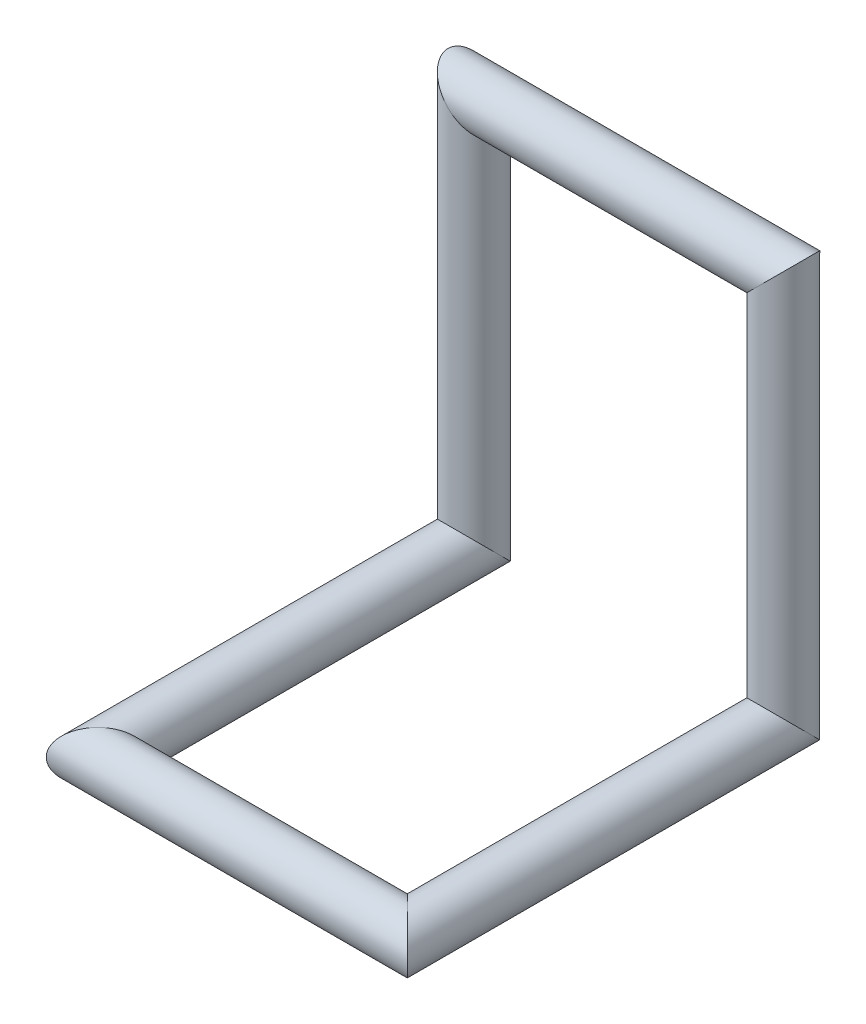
ISO-10303-21;
HEADER;
FILE_DESCRIPTION(('STEP AP214'),'2;1');
FILE_NAME('part.step','',(''),(''),'','','');
FILE_SCHEMA(('AUTOMOTIVE_DESIGN { 1 0 10303 214 1 1 1 1 }'));
ENDSEC;
DATA;
#1=APPLICATION_CONTEXT('core data for automotive mechanical design processes');
#2=APPLICATION_PROTOCOL_DEFINITION('international standard','automotive_design',2000,#1);
#3=PRODUCT_CONTEXT('',#1,'mechanical');
#4=PRODUCT('Part','Part','',(#3));
#5=PRODUCT_RELATED_PRODUCT_CATEGORY('part','',(#4));
#6=PRODUCT_DEFINITION_FORMATION('','',#4);
#7=PRODUCT_DEFINITION_CONTEXT('part definition',#1,'design');
#8=PRODUCT_DEFINITION('design','',#6,#7);
#9=PRODUCT_DEFINITION_SHAPE('','',#8);
#10=(LENGTH_UNIT() NAMED_UNIT(*) SI_UNIT(.MILLI.,.METRE.));
#11=(NAMED_UNIT(*) PLANE_ANGLE_UNIT() SI_UNIT($,.RADIAN.));
#12=(NAMED_UNIT(*) SI_UNIT($,.STERADIAN.) SOLID_ANGLE_UNIT());
#13=UNCERTAINTY_MEASURE_WITH_UNIT(LENGTH_MEASURE(1.E-05),#10,'distance_accuracy_value','');
#14=(GEOMETRIC_REPRESENTATION_CONTEXT(3) GLOBAL_UNCERTAINTY_ASSIGNED_CONTEXT((#13)) GLOBAL_UNIT_ASSIGNED_CONTEXT((#10,
#11,#12)) REPRESENTATION_CONTEXT('',''));
#15=CARTESIAN_POINT('',(0.,0.,0.));
#16=DIRECTION('',(0.,0.,1.));
#17=DIRECTION('',(1.,0.,0.));
#18=AXIS2_PLACEMENT_3D('',#15,#16,#17);
#19=CARTESIAN_POINT('',(76.2,0.,92.5693200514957));
#20=DIRECTION('',(0.,0.,-1.));
#21=DIRECTION('',(-1.,0.,0.));
#22=AXIS2_PLACEMENT_3D('',#19,#20,#21);
#23=CYLINDRICAL_SURFACE('',#22,6.35);
#24=CARTESIAN_POINT('',(76.2,0.,92.5693200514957));
#25=DIRECTION('',(0.707106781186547,0.,-0.707106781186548));
#26=DIRECTION('',(0.707106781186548,0.,0.707106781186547));
#27=AXIS2_PLACEMENT_3D('',#24,#25,#26);
#28=ELLIPSE('',#27,8.98025612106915,6.35);
#29=CARTESIAN_POINT('',(82.55,0.,98.9193200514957));
#30=VERTEX_POINT('',#29);
#31=EDGE_CURVE('E44',#30,#30,#28,.T.);
#32=ORIENTED_EDGE('',*,*,#31,.T.);
#33=EDGE_LOOP('',(#32));
#34=FACE_BOUND('',#33,.T.);
#35=CARTESIAN_POINT('',(76.2,-6.35000000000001,-6.35000000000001));
#36=CARTESIAN_POINT('',(76.246153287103,-6.35000043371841,-6.35000009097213));
#37=CARTESIAN_POINT('',(76.2923065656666,-6.34949683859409,-6.34949597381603));
#38=CARTESIAN_POINT('',(76.3846077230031,-6.34748384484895,-6.34748203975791));
#39=CARTESIAN_POINT('',(76.4307555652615,-6.34597360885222,-6.34597138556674));
#40=CARTESIAN_POINT('',(76.5230236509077,-6.34194696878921,-6.34194447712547));
#41=CARTESIAN_POINT('',(76.5691437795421,-6.33942925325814,-6.33942691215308));
#42=CARTESIAN_POINT('',(76.6613355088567,-6.33338827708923,-6.33338664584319));
#43=CARTESIAN_POINT('',(76.7074068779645,-6.32986323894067,-6.32986216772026));
#44=CARTESIAN_POINT('',(76.7764190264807,-6.32382602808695,-6.32382569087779));
#45=CARTESIAN_POINT('',(76.7994261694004,-6.32168661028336,-6.32168650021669));
#46=CARTESIAN_POINT('',(76.8453473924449,-6.31716376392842,-6.31716387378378));
#47=CARTESIAN_POINT('',(76.8682615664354,-6.31478081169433,-6.31478091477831));
#48=CARTESIAN_POINT('',(76.9370445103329,-6.30724954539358,-6.30724939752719));
#49=CARTESIAN_POINT('',(76.982832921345,-6.30172939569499,-6.30172877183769));
#50=CARTESIAN_POINT('',(77.0743302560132,-6.28968872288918,-6.28968737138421));
#51=CARTESIAN_POINT('',(77.1200381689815,-6.28316437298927,-6.28316277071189));
#52=CARTESIAN_POINT('',(77.2113535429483,-6.26911534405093,-6.26911368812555));
#53=CARTESIAN_POINT('',(77.25695970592,-6.26158644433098,-6.26158498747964));
#54=CARTESIAN_POINT('',(77.3480493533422,-6.24552893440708,-6.24552822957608));
#55=CARTESIAN_POINT('',(77.393531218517,-6.23699573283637,-6.23699558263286));
#56=CARTESIAN_POINT('',(77.484059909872,-6.21898845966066,-6.21898860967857));
#57=CARTESIAN_POINT('',(77.5291072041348,-6.20951556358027,-6.20951546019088));
#58=CARTESIAN_POINT('',(77.6190715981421,-6.18957768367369,-6.18957686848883));
#59=CARTESIAN_POINT('',(77.663986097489,-6.17910683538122,-6.17910556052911));
#60=CARTESIAN_POINT('',(77.7536624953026,-6.15717287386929,-6.15717112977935));
#61=CARTESIAN_POINT('',(77.7984213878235,-6.14570361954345,-6.14570186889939));
#62=CARTESIAN_POINT('',(77.8877650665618,-6.12177284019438,-6.12177149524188));
#63=CARTESIAN_POINT('',(77.9323464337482,-6.10930492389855,-6.10930399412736));
#64=CARTESIAN_POINT('',(77.9989462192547,-6.08989582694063,-6.08989552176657));
#65=CARTESIAN_POINT('',(78.0211608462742,-6.08328930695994,-6.08328921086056));
#66=CARTESIAN_POINT('',(78.0653162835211,-6.06989490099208,-6.06989499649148));
#67=CARTESIAN_POINT('',(78.0872579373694,-6.06310840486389,-6.06310848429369));
#68=CARTESIAN_POINT('',(78.1531544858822,-6.04233548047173,-6.04233526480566));
#69=CARTESIAN_POINT('',(78.196901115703,-6.02801722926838,-6.02801648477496));
#70=CARTESIAN_POINT('',(78.2841920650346,-5.99839863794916,-5.99839710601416));
#71=CARTESIAN_POINT('',(78.3277313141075,-5.98309083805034,-5.98308904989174));
#72=CARTESIAN_POINT('',(78.4145854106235,-5.95149275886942,-5.95149095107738));
#73=CARTESIAN_POINT('',(78.4578947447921,-5.93519490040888,-5.93519333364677));
#74=CARTESIAN_POINT('',(78.5442657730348,-5.90161711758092,-5.90161638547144));
#75=CARTESIAN_POINT('',(78.5873215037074,-5.88432952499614,-5.88432938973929));
#76=CARTESIAN_POINT('',(78.6725861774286,-5.84901174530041,-5.84901188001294));
#77=CARTESIAN_POINT('',(78.7147978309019,-5.83098482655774,-5.83098463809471));
#78=CARTESIAN_POINT('',(78.7989735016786,-5.79396003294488,-5.79395901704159));
#79=CARTESIAN_POINT('',(78.8409303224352,-5.77495398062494,-5.77495245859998));
#80=CARTESIAN_POINT('',(78.9245724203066,-5.73597041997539,-5.73596840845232));
#81=CARTESIAN_POINT('',(78.9662500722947,-5.71598473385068,-5.71598274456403));
#82=CARTESIAN_POINT('',(79.049310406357,-5.67504159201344,-5.67504011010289));
#83=CARTESIAN_POINT('',(79.090685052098,-5.65407597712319,-5.65407498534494));
#84=CARTESIAN_POINT('',(79.1523375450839,-5.62198769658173,-5.62198738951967));
#85=CARTESIAN_POINT('',(79.1729025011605,-5.6111397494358,-5.61113966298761));
#86=CARTESIAN_POINT('',(79.2135898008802,-5.58939193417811,-5.58939201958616));
#87=CARTESIAN_POINT('',(79.2337144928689,-5.57849426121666,-5.57849430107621));
#88=CARTESIAN_POINT('',(79.2941580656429,-5.54534134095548,-5.54534098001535));
#89=CARTESIAN_POINT('',(79.334181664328,-5.52281617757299,-5.52281519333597));
#90=CARTESIAN_POINT('',(79.4139138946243,-5.47680577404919,-5.47680389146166));
#91=CARTESIAN_POINT('',(79.4536129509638,-5.45331224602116,-5.45331009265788));
#92=CARTESIAN_POINT('',(79.5326714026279,-5.40536441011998,-5.40536230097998));
#93=CARTESIAN_POINT('',(79.5720208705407,-5.3809019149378,-5.38090012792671));
#94=CARTESIAN_POINT('',(79.650354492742,-5.33101643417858,-5.33101564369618));
#95=CARTESIAN_POINT('',(79.6893283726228,-5.3055853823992,-5.30558527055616));
#96=CARTESIAN_POINT('',(79.7660468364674,-5.25432374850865,-5.25432385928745));
#97=CARTESIAN_POINT('',(79.8037995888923,-5.22849927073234,-5.22849893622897));
#98=CARTESIAN_POINT('',(79.8789523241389,-5.17590003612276,-5.1758986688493));
#99=CARTESIAN_POINT('',(79.9163410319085,-5.14911722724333,-5.14911527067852));
#100=CARTESIAN_POINT('',(79.9907387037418,-5.09460056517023,-5.09459808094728));
#101=CARTESIAN_POINT('',(80.0277360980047,-5.06685881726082,-5.06685640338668));
#102=CARTESIAN_POINT('',(80.1013242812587,-5.01042385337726,-5.01042212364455));
#103=CARTESIAN_POINT('',(80.1379032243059,-4.98172290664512,-4.98172179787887));
#104=CARTESIAN_POINT('',(80.1922658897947,-4.9381028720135,-4.93810255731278));
#105=CARTESIAN_POINT('',(80.2103896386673,-4.92339492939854,-4.92339485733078));
#106=CARTESIAN_POINT('',(80.2460416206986,-4.89413610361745,-4.89413617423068));
#107=CARTESIAN_POINT('',(80.2635744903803,-4.879588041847,-4.8795880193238));
#108=CARTESIAN_POINT('',(80.316213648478,-4.83543154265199,-4.83543094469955));
#109=CARTESIAN_POINT('',(80.350977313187,-4.80561846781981,-4.80561708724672));
#110=CARTESIAN_POINT('',(80.4200904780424,-4.74504771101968,-4.7450452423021));
#111=CARTESIAN_POINT('',(80.4544269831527,-4.71428262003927,-4.71427985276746));
#112=CARTESIAN_POINT('',(80.5226567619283,-4.65180700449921,-4.65180438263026));
#113=CARTESIAN_POINT('',(80.5565368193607,-4.62008925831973,-4.62008709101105));
#114=CARTESIAN_POINT('',(80.6238238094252,-4.55570867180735,-4.5557077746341));
#115=CARTESIAN_POINT('',(80.6572173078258,-4.52303881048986,-4.52303873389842));
#116=CARTESIAN_POINT('',(80.7224350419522,-4.45782108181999,-4.45782115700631));
#117=CARTESIAN_POINT('',(80.7542768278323,-4.42528197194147,-4.42528140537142));
#118=CARTESIAN_POINT('',(80.8175196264,-4.3592584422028,-4.35925650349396));
#119=CARTESIAN_POINT('',(80.8489063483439,-4.32576717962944,-4.3257645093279));
#120=CARTESIAN_POINT('',(80.9112067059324,-4.2578383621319,-4.2578350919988));
#121=CARTESIAN_POINT('',(80.94210586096,-4.2233941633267,-4.22339103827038));
#122=CARTESIAN_POINT('',(81.0033985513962,-4.15355910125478,-4.15355694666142));
#123=CARTESIAN_POINT('',(81.0337774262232,-4.11816179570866,-4.11816047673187));
#124=CARTESIAN_POINT('',(81.07877337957,-4.06455688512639,-4.06455654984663));
#125=CARTESIAN_POINT('',(81.0937576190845,-4.04650280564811,-4.04650275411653));
#126=CARTESIAN_POINT('',(81.1229988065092,-4.01087231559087,-4.0108723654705));
#127=CARTESIAN_POINT('',(81.1372636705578,-3.9932991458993,-3.9932990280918));
#128=CARTESIAN_POINT('',(81.1800600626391,-3.93999943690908,-3.9399984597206));
#129=CARTESIAN_POINT('',(81.2082290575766,-3.90412712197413,-3.90412509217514));
#130=CARTESIAN_POINT('',(81.2640726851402,-3.83142316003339,-3.83141971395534));
#131=CARTESIAN_POINT('',(81.2917315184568,-3.79458544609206,-3.79458164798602));
#132=CARTESIAN_POINT('',(81.3465183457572,-3.71994982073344,-3.71994632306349));
#133=CARTESIAN_POINT('',(81.3736303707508,-3.68214604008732,-3.68214321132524));
#134=CARTESIAN_POINT('',(81.4272862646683,-3.60557882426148,-3.60557773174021));
#135=CARTESIAN_POINT('',(81.4538139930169,-3.56680973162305,-3.56680971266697));
#136=CARTESIAN_POINT('',(81.5050131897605,-3.49018472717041,-3.49018474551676));
#137=CARTESIAN_POINT('',(81.5297169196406,-3.45233955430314,-3.45233860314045));
#138=CARTESIAN_POINT('',(81.5786205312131,-3.37565500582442,-3.3756520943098));
#139=CARTESIAN_POINT('',(81.6028030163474,-3.33681008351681,-3.33680618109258));
#140=CARTESIAN_POINT('',(81.6506220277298,-3.25812475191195,-3.25812010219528));
#141=CARTESIAN_POINT('',(81.6742409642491,-3.21827898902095,-3.21827460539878));
#142=CARTESIAN_POINT('',(81.7208901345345,-3.13759174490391,-3.13758881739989));
#143=CARTESIAN_POINT('',(81.74390258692,-3.09674511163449,-3.09674339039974));
#144=CARTESIAN_POINT('',(81.7777997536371,-3.03499766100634,-3.03499727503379));
#145=CARTESIAN_POINT('',(81.7890653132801,-3.01420086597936,-3.01420084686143));
#146=CARTESIAN_POINT('',(81.8107613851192,-2.97361037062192,-2.97361038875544));
#147=CARTESIAN_POINT('',(81.8212050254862,-2.95382016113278,-2.95381988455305));
#148=CARTESIAN_POINT('',(81.8525073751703,-2.89373830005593,-2.89373665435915));
#149=CARTESIAN_POINT('',(81.8729999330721,-2.85335118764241,-2.85334797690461));
#150=CARTESIAN_POINT('',(81.9134379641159,-2.7715072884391,-2.77150202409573));
#151=CARTESIAN_POINT('',(81.9333635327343,-2.73004557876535,-2.73003984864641));
#152=CARTESIAN_POINT('',(81.9726166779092,-2.64605154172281,-2.6460463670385));
#153=CARTESIAN_POINT('',(81.9919240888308,-2.60351448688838,-2.60351036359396));
#154=CARTESIAN_POINT('',(82.02988885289,-2.51737067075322,-2.51736918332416));
#155=CARTESIAN_POINT('',(82.0485257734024,-2.47375940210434,-2.47375950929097));
#156=CARTESIAN_POINT('',(82.0837104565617,-2.38881608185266,-2.38881598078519));
#157=CARTESIAN_POINT('',(82.1003167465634,-2.34749604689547,-2.347494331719));
#158=CARTESIAN_POINT('',(82.1330031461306,-2.26363630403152,-2.26363140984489));
#159=CARTESIAN_POINT('',(82.14905962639,-2.22109198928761,-2.22108553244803));
#160=CARTESIAN_POINT('',(82.1805826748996,-2.13478172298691,-2.13477415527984));
#161=CARTESIAN_POINT('',(82.1960251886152,-2.09101135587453,-2.09100429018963));
#162=CARTESIAN_POINT('',(82.226255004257,-2.00224898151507,-2.00224435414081));
#163=CARTESIAN_POINT('',(82.2410178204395,-1.95725278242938,-1.95725012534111));
#164=CARTESIAN_POINT('',(82.2624955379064,-1.8892396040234,-1.88923908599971));
#165=CARTESIAN_POINT('',(82.2696014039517,-1.86628381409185,-1.86628387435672));
#166=CARTESIAN_POINT('',(82.2828883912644,-1.82248248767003,-1.82248243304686));
#167=CARTESIAN_POINT('',(82.2890938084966,-1.80164057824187,-1.80163994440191));
#168=CARTESIAN_POINT('',(82.3076850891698,-1.73800713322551,-1.73800391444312));
#169=CARTESIAN_POINT('',(82.3197136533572,-1.69516355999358,-1.69515747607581));
#170=CARTESIAN_POINT('',(82.343220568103,-1.60793293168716,-1.60792307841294));
#171=CARTESIAN_POINT('',(82.3546676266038,-1.56354163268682,-1.56353094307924));
#172=CARTESIAN_POINT('',(82.3769225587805,-1.47321414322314,-1.47320468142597));
#173=CARTESIAN_POINT('',(82.3876982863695,-1.42727394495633,-1.42726664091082));
#174=CARTESIAN_POINT('',(82.4085185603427,-1.3338508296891,-1.33384801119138));
#175=CARTESIAN_POINT('',(82.4185300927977,-1.28636422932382,-1.2863637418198));
#176=CARTESIAN_POINT('',(82.4367672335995,-1.19468000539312,-1.19468045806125));
#177=CARTESIAN_POINT('',(82.4450693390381,-1.15048983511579,-1.15048915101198));
#178=CARTESIAN_POINT('',(82.4631746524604,-1.04815306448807,-1.04815190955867));
#179=CARTESIAN_POINT('',(82.4726322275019,-0.989975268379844,-0.989975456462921));
#180=CARTESIAN_POINT('',(82.48612991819,-0.898981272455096,-0.898981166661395));
#181=CARTESIAN_POINT('',(82.4907298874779,-0.8662053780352,-0.866204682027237));
#182=CARTESIAN_POINT('',(82.5011811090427,-0.787263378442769,-0.787261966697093));
#183=CARTESIAN_POINT('',(82.5067790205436,-0.741080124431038,-0.74107887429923));
#184=CARTESIAN_POINT('',(82.5145245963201,-0.67072290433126,-0.670722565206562));
#185=CARTESIAN_POINT('',(82.5170434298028,-0.646569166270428,-0.646569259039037));
#186=CARTESIAN_POINT('',(82.5214910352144,-0.601411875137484,-0.601411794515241));
#187=CARTESIAN_POINT('',(82.5234538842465,-0.580409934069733,-0.580409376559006));
#188=CARTESIAN_POINT('',(82.5293312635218,-0.513952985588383,-0.513951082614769));
#189=CARTESIAN_POINT('',(82.5328591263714,-0.468480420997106,-0.468477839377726));
#190=CARTESIAN_POINT('',(82.5383746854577,-0.385863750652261,-0.385862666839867));
#191=CARTESIAN_POINT('',(82.5405262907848,-0.348725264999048,-0.348725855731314));
#192=CARTESIAN_POINT('',(82.5447643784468,-0.262457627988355,-0.262456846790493));
#193=CARTESIAN_POINT('',(82.5466061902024,-0.213323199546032,-0.213317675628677));
#194=CARTESIAN_POINT('',(82.5492924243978,-0.109460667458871,-0.109453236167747));
#195=CARTESIAN_POINT('',(82.5499999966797,-0.0547303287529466,-0.054726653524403));
#196=CARTESIAN_POINT('',(82.5500000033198,0.0547225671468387,0.0547188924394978));
#197=CARTESIAN_POINT('',(82.5492926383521,0.109445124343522,0.109437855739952));
#198=CARTESIAN_POINT('',(82.5468167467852,0.20518753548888,0.205181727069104));
#199=CARTESIAN_POINT('',(82.5453577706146,0.246212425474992,0.24620973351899));
#200=CARTESIAN_POINT('',(82.5431330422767,0.295345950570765,0.295345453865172));
#201=CARTESIAN_POINT('',(82.5427498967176,0.303462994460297,0.303462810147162));
#202=CARTESIAN_POINT('',(82.5405268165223,0.348714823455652,0.348715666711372));
#203=CARTESIAN_POINT('',(82.5383758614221,0.385843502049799,0.385842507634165));
#204=CARTESIAN_POINT('',(82.5328611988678,0.468452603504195,0.468449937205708));
#205=CARTESIAN_POINT('',(82.5293333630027,0.513927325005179,0.513925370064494));
#206=CARTESIAN_POINT('',(82.5234553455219,0.580394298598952,0.580393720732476));
#207=CARTESIAN_POINT('',(82.5214918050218,0.601404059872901,0.601403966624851));
#208=CARTESIAN_POINT('',(82.5170442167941,0.646561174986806,0.646561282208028));
#209=CARTESIAN_POINT('',(82.51452626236,0.670706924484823,0.670706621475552));
#210=CARTESIAN_POINT('',(82.5067820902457,0.74105385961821,0.741052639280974));
#211=CARTESIAN_POINT('',(82.5011846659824,0.78723479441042,0.787233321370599));
#212=CARTESIAN_POINT('',(82.4907327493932,0.86618498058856,0.866184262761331));
#213=CARTESIAN_POINT('',(82.4861313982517,0.898971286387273,0.898971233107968));
#214=CARTESIAN_POINT('',(82.4795066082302,0.943631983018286,0.943632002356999));
#215=CARTESIAN_POINT('',(82.4777082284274,0.955522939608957,0.955522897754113));
#216=CARTESIAN_POINT('',(82.4687367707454,1.01372337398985,1.01372291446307));
#217=CARTESIAN_POINT('',(82.4610790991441,1.05999630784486,1.05999514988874));
#218=CARTESIAN_POINT('',(82.4450736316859,1.15046697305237,1.1504662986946));
#219=CARTESIAN_POINT('',(82.4367694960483,1.19466862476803,1.19466905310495));
#220=CARTESIAN_POINT('',(82.4185316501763,1.28635640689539,1.28635594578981));
#221=CARTESIAN_POINT('',(82.4085218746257,1.33383511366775,1.3338324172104));
#222=CARTESIAN_POINT('',(82.38770445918,1.42724706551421,1.42723990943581));
#223=CARTESIAN_POINT('',(82.3769297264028,1.47318397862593,1.47317459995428));
#224=CARTESIAN_POINT('',(82.3546758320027,1.56350936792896,1.56349863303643));
#225=CARTESIAN_POINT('',(82.3432287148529,1.60790183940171,1.60789187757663));
#226=CARTESIAN_POINT('',(82.319720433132,1.69513923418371,1.69513295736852));
#227=CARTESIAN_POINT('',(82.3076904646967,1.73798838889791,1.73798495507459));
#228=CARTESIAN_POINT('',(82.2890964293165,1.8016317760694,1.80163103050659));
#229=CARTESIAN_POINT('',(82.2828897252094,1.82247809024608,1.82247797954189));
#230=CARTESIAN_POINT('',(82.2696027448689,1.86627939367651,1.86627951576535));
#231=CARTESIAN_POINT('',(82.2624982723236,1.8892307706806,1.88923037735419));
#232=CARTESIAN_POINT('',(82.2410238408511,1.95723406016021,1.9572316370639));
#233=CARTESIAN_POINT('',(82.2262629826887,2.00222483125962,2.00222040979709));
#234=CARTESIAN_POINT('',(82.1960358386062,2.0909807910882,2.09097381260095));
#235=CARTESIAN_POINT('',(82.1805939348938,2.1347501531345,2.13474258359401));
#236=CARTESIAN_POINT('',(82.1490705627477,2.22106276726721,2.22105613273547));
#237=CARTESIAN_POINT('',(82.1330130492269,2.26361041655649,2.26360525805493));
#238=CARTESIAN_POINT('',(82.1003227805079,2.34748103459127,2.34747908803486));
#239=CARTESIAN_POINT('',(82.083713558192,2.38880859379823,2.38880837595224));
#240=CARTESIAN_POINT('',(82.0485288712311,2.47375192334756,2.47375215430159));
#241=CARTESIAN_POINT('',(82.029895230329,2.51735574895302,2.51735451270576));
#242=CARTESIAN_POINT('',(81.9919354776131,2.60348908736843,2.60348523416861));
#243=CARTESIAN_POINT('',(81.9726296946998,2.6460230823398,2.64601807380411));
#244=CARTESIAN_POINT('',(81.9333779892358,2.73001523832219,2.73000945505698));
#245=CARTESIAN_POINT('',(81.9134521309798,2.77147810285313,2.77147267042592));
#246=CARTESIAN_POINT('',(81.8730114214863,2.85332843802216,2.85332490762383));
#247=CARTESIAN_POINT('',(81.8525163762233,2.89372080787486,2.89371880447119));
#248=CARTESIAN_POINT('',(81.8212093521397,2.95381196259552,2.95381149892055));
#249=CARTESIAN_POINT('',(81.8107635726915,2.97360627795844,2.97360620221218));
#250=CARTESIAN_POINT('',(81.789067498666,3.01419677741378,3.01419685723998));
#251=CARTESIAN_POINT('',(81.7778041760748,3.0349894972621,3.03498931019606));
#252=CARTESIAN_POINT('',(81.7439121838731,3.09672784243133,3.09672649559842));
#253=CARTESIAN_POINT('',(81.7209027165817,3.13756951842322,3.13756692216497));
#254=CARTESIAN_POINT('',(81.6742574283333,3.21825096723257,3.21824673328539));
#255=CARTESIAN_POINT('',(81.6506392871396,3.25809586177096,3.25809122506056));
#256=CARTESIAN_POINT('',(81.6028194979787,3.33678344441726,3.33677928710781));
#257=CARTESIAN_POINT('',(81.5786353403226,3.37563145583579,3.37562815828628));
#258=CARTESIAN_POINT('',(81.5297257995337,3.4523259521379,3.45232465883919));
#259=CARTESIAN_POINT('',(81.5050177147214,3.49017795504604,3.49017780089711));
#260=CARTESIAN_POINT('',(81.4538184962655,3.56680299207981,3.56680315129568));
#261=CARTESIAN_POINT('',(81.4272954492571,3.60556540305,3.60556467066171));
#262=CARTESIAN_POINT('',(81.3736465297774,3.68212329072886,3.68212085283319));
#263=CARTESIAN_POINT('',(81.3465366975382,3.71992438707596,3.71992113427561));
#264=CARTESIAN_POINT('',(81.2917516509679,3.79455844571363,3.79455458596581));
#265=CARTESIAN_POINT('',(81.2640923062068,3.83139724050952,3.83139357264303));
#266=CARTESIAN_POINT('',(81.2082447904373,3.90410700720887,3.90410454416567));
#267=CARTESIAN_POINT('',(81.1800723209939,3.93998400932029,3.93998254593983));
#268=CARTESIAN_POINT('',(81.1372695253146,3.99329193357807,3.99329156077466));
#269=CARTESIAN_POINT('',(81.123001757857,4.01086871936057,4.01086864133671));
#270=CARTESIAN_POINT('',(81.0937605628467,4.04649921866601,4.04649929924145));
#271=CARTESIAN_POINT('',(81.0787793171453,4.06454973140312,4.06454966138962));
#272=CARTESIAN_POINT('',(81.0337902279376,4.11814670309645,4.11814588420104));
#273=CARTESIAN_POINT('',(81.0034152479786,4.15353972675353,4.15353801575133));
#274=CARTESIAN_POINT('',(80.9421274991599,4.22336985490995,4.22336693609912));
#275=CARTESIAN_POINT('',(80.911229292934,4.25781335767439,4.25781011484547));
#276=CARTESIAN_POINT('',(80.8489277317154,4.32574423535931,4.32574124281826));
#277=CARTESIAN_POINT('',(80.8175387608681,4.35923820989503,4.35923577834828));
#278=CARTESIAN_POINT('',(80.7542882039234,4.42527034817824,4.425269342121));
#279=CARTESIAN_POINT('',(80.7224408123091,4.45781531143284,4.45781516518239));
#280=CARTESIAN_POINT('',(80.6572230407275,4.52303307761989,4.52303322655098));
#281=CARTESIAN_POINT('',(80.6238354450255,4.55569728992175,4.55569684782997));
#282=CARTESIAN_POINT('',(80.5565571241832,4.62007007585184,4.62006840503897));
#283=CARTESIAN_POINT('',(80.5226797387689,4.65178561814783,4.65178331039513));
#284=CARTESIAN_POINT('',(80.454452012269,4.71426004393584,4.71425720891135));
#285=CARTESIAN_POINT('',(80.4201147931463,4.74502609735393,4.74502336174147));
#286=CARTESIAN_POINT('',(80.3509966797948,4.80560179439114,4.8055998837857));
#287=CARTESIAN_POINT('',(80.3162286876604,4.83541879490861,4.83541760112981));
#288=CARTESIAN_POINT('',(80.2635816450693,4.8795821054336,4.87958176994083));
#289=CARTESIAN_POINT('',(80.2460452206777,4.89413314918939,4.89413306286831));
#290=CARTESIAN_POINT('',(80.21039322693,4.92339198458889,4.92339207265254));
#291=CARTESIAN_POINT('',(80.1922731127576,4.93809701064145,4.93809701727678));
#292=CARTESIAN_POINT('',(80.1379187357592,4.98171059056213,4.98171008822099));
#293=CARTESIAN_POINT('',(80.1013444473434,5.0104080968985,5.01040690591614));
#294=CARTESIAN_POINT('',(80.0277620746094,5.06683918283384,5.06683702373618));
#295=CARTESIAN_POINT('',(79.9907657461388,5.09458043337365,5.09457798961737));
#296=CARTESIAN_POINT('',(79.916366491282,5.14909888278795,5.14909654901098));
#297=CARTESIAN_POINT('',(79.878975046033,5.17588391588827,5.17588196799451));
#298=CARTESIAN_POINT('',(79.8038130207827,5.22849008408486,5.22848922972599));
#299=CARTESIAN_POINT('',(79.766053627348,5.25431921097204,5.25431906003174));
#300=CARTESIAN_POINT('',(79.6893351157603,5.30558087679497,5.30558102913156));
#301=CARTESIAN_POINT('',(79.6503681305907,5.33100753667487,5.3310072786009));
#302=CARTESIAN_POINT('',(79.5720445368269,5.38088705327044,5.38088584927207));
#303=CARTESIAN_POINT('',(79.5326981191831,5.40534790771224,5.40534616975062));
#304=CARTESIAN_POINT('',(79.4536419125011,5.45329497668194,5.45329275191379));
#305=CARTESIAN_POINT('',(79.4139419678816,5.47678930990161,5.47678712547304));
#306=CARTESIAN_POINT('',(79.3342039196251,5.52280359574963,5.52280200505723));
#307=CARTESIAN_POINT('',(79.2941753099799,5.54533176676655,5.54533072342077));
#308=CARTESIAN_POINT('',(79.2337226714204,5.57848983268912,5.57848951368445));
#309=CARTESIAN_POINT('',(79.2135939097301,5.58938973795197,5.58938964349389));
#310=CARTESIAN_POINT('',(79.172906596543,5.6111375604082,5.6111376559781));
#311=CARTESIAN_POINT('',(79.1523457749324,5.6219833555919,5.62198341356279));
#312=CARTESIAN_POINT('',(79.0907026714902,5.65406692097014,5.65406661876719));
#313=CARTESIAN_POINT('',(79.0493332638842,5.67503006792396,5.67502919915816));
#314=CARTESIAN_POINT('',(78.966279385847,5.7159705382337,5.71596884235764));
#315=CARTESIAN_POINT('',(78.9246028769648,5.73595594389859,5.73595398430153));
#316=CARTESIAN_POINT('',(78.8409588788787,5.77494094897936,5.77493900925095));
#317=CARTESIAN_POINT('',(78.7989989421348,5.793948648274,5.79394698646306));
#318=CARTESIAN_POINT('',(78.7148128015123,5.83097843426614,5.83097766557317));
#319=CARTESIAN_POINT('',(78.6725937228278,5.84900861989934,5.84900846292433));
#320=CARTESIAN_POINT('',(78.5873290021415,5.88432641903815,5.8843265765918));
#321=CARTESIAN_POINT('',(78.5442808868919,5.90161105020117,5.90161090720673));
#322=CARTESIAN_POINT('',(78.4579208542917,5.93518493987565,5.9351840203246));
#323=CARTESIAN_POINT('',(78.4146148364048,5.95148178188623,5.95148038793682));
#324=CARTESIAN_POINT('',(78.3277630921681,5.98307954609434,5.98307768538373));
#325=CARTESIAN_POINT('',(78.2842228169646,5.99838796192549,5.9983861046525));
#326=CARTESIAN_POINT('',(78.1969254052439,6.02800922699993,6.02800782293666));
#327=CARTESIAN_POINT('',(78.1531732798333,6.04232944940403,6.04232849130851));
#328=CARTESIAN_POINT('',(78.0872668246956,6.06310565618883,6.06310534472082));
#329=CARTESIAN_POINT('',(78.0653207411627,6.06989354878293,6.06989344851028));
#330=CARTESIAN_POINT('',(78.0211652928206,6.08328795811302,6.08328805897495));
#331=CARTESIAN_POINT('',(77.998955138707,6.0898931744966,6.08989326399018));
#332=CARTESIAN_POINT('',(77.9323654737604,6.10929948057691,6.10929929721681));
#333=CARTESIAN_POINT('',(77.8877897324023,6.12176599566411,6.12176531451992));
#334=CARTESIAN_POINT('',(77.7984529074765,6.14569541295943,6.14569398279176));
#335=CARTESIAN_POINT('',(77.753695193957,6.15716461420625,6.15716293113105));
#336=CARTESIAN_POINT('',(77.664016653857,6.17909962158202,6.17909790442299));
#337=CARTESIAN_POINT('',(77.6190987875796,6.18957147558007,6.18956997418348));
#338=CARTESIAN_POINT('',(77.5291231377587,6.20951221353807,6.20951149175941));
#339=CARTESIAN_POINT('',(77.4840679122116,6.21898686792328,6.21898670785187));
#340=CARTESIAN_POINT('',(77.3935391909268,6.23699414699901,6.23699430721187));
#341=CARTESIAN_POINT('',(77.3480653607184,6.24552593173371,6.24552584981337));
#342=CARTESIAN_POINT('',(77.2569872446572,6.26158176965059,6.26158099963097));
#343=CARTESIAN_POINT('',(77.2113845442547,6.2691103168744,6.26910910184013));
#344=CARTESIAN_POINT('',(77.1200715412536,6.28315949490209,6.28315782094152));
#345=CARTESIAN_POINT('',(77.074362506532,6.28968424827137,6.28968255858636));
#346=CARTESIAN_POINT('',(76.982858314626,6.30172628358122,6.30172497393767));
#347=CARTESIAN_POINT('',(76.9370641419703,6.3072472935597,6.30724637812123));
#348=CARTESIAN_POINT('',(76.868270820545,6.31477984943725,6.31477954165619));
#349=CARTESIAN_POINT('',(76.8453520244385,6.31716330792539,6.3171632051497));
#350=CARTESIAN_POINT('',(76.7994284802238,6.32168638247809,6.32168648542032));
#351=CARTESIAN_POINT('',(76.7764236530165,6.32382559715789,6.32382570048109));
#352=CARTESIAN_POINT('',(76.7074167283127,6.32986242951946,6.32986229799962));
#353=CARTESIAN_POINT('',(76.6613482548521,6.33338733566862,6.33338673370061));
#354=CARTESIAN_POINT('',(76.569160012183,6.33942829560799,6.3394269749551));
#355=CARTESIAN_POINT('',(76.5230404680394,6.34194607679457,6.34194450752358));
#356=CARTESIAN_POINT('',(76.4307712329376,6.34597308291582,6.34597145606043));
#357=CARTESIAN_POINT('',(76.384621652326,6.3474835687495,6.34748213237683));
#358=CARTESIAN_POINT('',(76.2923146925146,6.34949663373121,6.34949593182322));
#359=CARTESIAN_POINT('',(76.2461573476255,6.35000000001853,6.34999984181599));
#360=CARTESIAN_POINT('',(76.1538507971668,6.34999999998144,6.35000015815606));
#361=CARTESIAN_POINT('',(76.1077015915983,6.34949681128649,6.34949674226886));
#362=CARTESIAN_POINT('',(76.0154062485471,6.34748435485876,6.34748361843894));
#363=CARTESIAN_POINT('',(75.9692601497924,6.34597419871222,6.34597302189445));
#364=CARTESIAN_POINT('',(75.8769932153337,6.34194780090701,6.34194616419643));
#365=CARTESIAN_POINT('',(75.8308724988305,6.33943019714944,6.33942854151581));
#366=CARTESIAN_POINT('',(75.7386772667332,6.33338923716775,6.33338794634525));
#367=CARTESIAN_POINT('',(75.6926029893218,6.32986405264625,6.32986314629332));
#368=CARTESIAN_POINT('',(75.6235856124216,6.32382645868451,6.32382615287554));
#369=CARTESIAN_POINT('',(75.6005761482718,6.32168683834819,6.32168673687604));
#370=CARTESIAN_POINT('',(75.5546526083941,6.31716376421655,6.31716386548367));
#371=CARTESIAN_POINT('',(75.5317384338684,6.31478081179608,6.31478091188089));
#372=CARTESIAN_POINT('',(75.4629554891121,6.3072495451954,6.30724940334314));
#373=CARTESIAN_POINT('',(75.4171670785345,6.30172939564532,6.30172877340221));
#374=CARTESIAN_POINT('',(75.3256697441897,6.28968872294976,6.28968736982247));
#375=CARTESIAN_POINT('',(75.2799618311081,6.28316437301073,6.28316277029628));
#376=CARTESIAN_POINT('',(75.1886464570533,6.26911534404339,6.26911368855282));
#377=CARTESIAN_POINT('',(75.1430402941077,6.26158644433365,6.2615849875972));
#378=CARTESIAN_POINT('',(75.051950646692,6.24552893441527,6.24552822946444));
#379=CARTESIAN_POINT('',(75.0064687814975,6.23699573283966,6.23699558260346));
#380=CARTESIAN_POINT('',(74.9159400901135,6.21898845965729,6.21898860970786));
#381=CARTESIAN_POINT('',(74.8708927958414,6.20951556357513,6.20951546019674));
#382=CARTESIAN_POINT('',(74.7809284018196,6.18957768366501,6.18957686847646));
#383=CARTESIAN_POINT('',(74.7360139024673,6.17910683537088,6.17910556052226));
#384=CARTESIAN_POINT('',(74.6463375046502,6.15717287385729,6.15717112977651));
#385=CARTESIAN_POINT('',(74.6015786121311,6.14570361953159,6.14570186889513));
#386=CARTESIAN_POINT('',(74.5122349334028,6.12177284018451,6.12177149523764));
#387=CARTESIAN_POINT('',(74.4676535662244,6.10930492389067,6.10930399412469));
#388=CARTESIAN_POINT('',(74.4010537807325,6.08989582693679,6.08989552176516));
#389=CARTESIAN_POINT('',(74.3788391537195,6.08328930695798,6.08328921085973));
#390=CARTESIAN_POINT('',(74.3346837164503,6.06989490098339,6.06989499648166));
#391=CARTESIAN_POINT('',(74.3127420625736,6.06310840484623,6.06310848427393));
#392=CARTESIAN_POINT('',(74.2468455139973,6.04233548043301,6.04233526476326));
#393=CARTESIAN_POINT('',(74.2030988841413,6.02801722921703,6.02801648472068));
#394=CARTESIAN_POINT('',(74.1158079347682,5.99839863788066,5.99839710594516));
#395=CARTESIAN_POINT('',(74.0722686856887,5.98309083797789,5.98308904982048));
#396=CARTESIAN_POINT('',(73.9854145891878,5.95149275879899,5.95149095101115));
#397=CARTESIAN_POINT('',(73.9421052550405,5.93519490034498,5.93519333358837));
#398=CARTESIAN_POINT('',(73.8557342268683,5.90161711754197,5.90161638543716));
#399=CARTESIAN_POINT('',(73.8126784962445,5.88432952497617,5.8843293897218));
#400=CARTESIAN_POINT('',(73.7274138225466,5.84901174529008,5.84901188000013));
#401=CARTESIAN_POINT('',(73.6852021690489,5.83098482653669,5.83098463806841));
#402=CARTESIAN_POINT('',(73.6010264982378,5.79396003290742,5.79395901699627));
#403=CARTESIAN_POINT('',(73.5590696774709,5.77495398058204,5.77495245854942));
#404=CARTESIAN_POINT('',(73.4754275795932,5.73597041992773,5.73596840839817));
#405=CARTESIAN_POINT('',(73.4337499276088,5.71598473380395,5.7159827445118));
#406=CARTESIAN_POINT('',(73.3506895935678,5.67504159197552,5.67504011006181));
#407=CARTESIAN_POINT('',(73.3093149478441,5.65407597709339,5.65407498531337));
#408=CARTESIAN_POINT('',(73.2476624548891,5.62198769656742,5.62198738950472));
#409=CARTESIAN_POINT('',(73.2270974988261,5.61113974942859,5.61113966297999));
#410=CARTESIAN_POINT('',(73.1864101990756,5.5893919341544,5.58939201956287));
#411=CARTESIAN_POINT('',(73.1662855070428,5.57849426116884,5.57849430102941));
#412=CARTESIAN_POINT('',(73.1058419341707,5.54534134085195,5.54534097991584));
#413=CARTESIAN_POINT('',(73.0658183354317,5.52281617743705,5.52281519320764));
#414=CARTESIAN_POINT('',(72.9860861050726,5.4768057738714,5.47680389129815));
#415=CARTESIAN_POINT('',(72.9463870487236,5.45331224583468,5.45331009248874));
#416=CARTESIAN_POINT('',(72.8673285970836,5.40536440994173,5.4053623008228));
#417=CARTESIAN_POINT('',(72.8279791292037,5.38090191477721,5.38090012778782));
#418=CARTESIAN_POINT('',(72.7496455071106,5.33101643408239,5.33101564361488));
#419=CARTESIAN_POINT('',(72.7106716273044,5.30558538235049,5.30558527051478));
#420=CARTESIAN_POINT('',(72.6339531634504,5.25432374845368,5.25432385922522));
#421=CARTESIAN_POINT('',(72.5962004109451,5.22849927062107,5.22849893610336));
#422=CARTESIAN_POINT('',(72.5210476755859,5.17590003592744,5.17589866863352));
#423=CARTESIAN_POINT('',(72.483658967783,5.14911722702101,5.14911527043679));
#424=CARTESIAN_POINT('',(72.4092612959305,5.09460056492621,5.09459808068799));
#425=CARTESIAN_POINT('',(72.3722639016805,5.06685881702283,5.06685640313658));
#426=CARTESIAN_POINT('',(72.298675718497,5.01042385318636,5.01042212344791));
#427=CARTESIAN_POINT('',(72.2620967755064,4.98172290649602,4.98172179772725));
#428=CARTESIAN_POINT('',(72.2077341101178,4.93810287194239,4.93810255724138));
#429=CARTESIAN_POINT('',(72.1896103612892,4.92339492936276,4.923394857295));
#430=CARTESIAN_POINT('',(72.1539583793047,4.89413610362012,4.89413617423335));
#431=CARTESIAN_POINT('',(72.1364255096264,4.87958804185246,4.879588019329));
#432=CARTESIAN_POINT('',(72.083786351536,4.83543154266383,4.83543094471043));
#433=CARTESIAN_POINT('',(72.049022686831,4.80561846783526,4.8056170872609));
#434=CARTESIAN_POINT('',(71.9799095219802,4.74504771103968,4.74504524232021));
#435=CARTESIAN_POINT('',(71.9455730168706,4.71428262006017,4.71427985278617));
#436=CARTESIAN_POINT('',(71.877343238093,4.651807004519,4.65180438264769));
#437=CARTESIAN_POINT('',(71.8434631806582,4.62008925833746,4.62008709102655));
#438=CARTESIAN_POINT('',(71.7761761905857,4.55570867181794,4.55570777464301));
#439=CARTESIAN_POINT('',(71.7427826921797,4.52303881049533,4.52303873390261));
#440=CARTESIAN_POINT('',(71.6775649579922,4.45782108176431,4.45782115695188));
#441=CARTESIAN_POINT('',(71.6457231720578,4.42528197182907,4.42528140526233));
#442=CARTESIAN_POINT('',(71.5824803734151,4.35925844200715,4.35925650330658));
#443=CARTESIAN_POINT('',(71.5510936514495,4.32576717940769,4.32576450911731));
#444=CARTESIAN_POINT('',(71.4887932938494,4.25783836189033,4.25783509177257));
#445=CARTESIAN_POINT('',(71.457894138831,4.22339416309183,4.22339103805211));
#446=CARTESIAN_POINT('',(71.3966014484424,4.15355910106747,4.15355694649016));
#447=CARTESIAN_POINT('',(71.366222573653,4.11816179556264,4.11816047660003));
#448=CARTESIAN_POINT('',(71.3212266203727,4.06455688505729,4.06455654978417));
#449=CARTESIAN_POINT('',(71.3062423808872,4.04650280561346,4.04650275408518));
#450=CARTESIAN_POINT('',(71.2770011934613,4.01087231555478,4.01087236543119));
#451=CARTESIAN_POINT('',(71.2627363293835,3.99329914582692,3.99329902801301));
#452=CARTESIAN_POINT('',(71.2199399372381,3.93999943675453,3.93999845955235));
#453=CARTESIAN_POINT('',(71.1917709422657,3.90412712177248,3.90412509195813));
#454=CARTESIAN_POINT('',(71.135927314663,3.83142315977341,3.83141971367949));
#455=CARTESIAN_POINT('',(71.1082684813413,3.79458544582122,3.79458164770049));
#456=CARTESIAN_POINT('',(71.0534816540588,3.7199498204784,3.71994632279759));
#457=CARTESIAN_POINT('',(71.0263696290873,3.68214603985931,3.68214321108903));
#458=CARTESIAN_POINT('',(70.9727137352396,3.60557882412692,3.60557773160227));
#459=CARTESIAN_POINT('',(70.9461860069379,3.56680973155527,3.56680971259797));
#460=CARTESIAN_POINT('',(70.894986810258,3.49018472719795,3.49018474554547));
#461=CARTESIAN_POINT('',(70.8702830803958,3.45233955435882,3.45233860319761));
#462=CARTESIAN_POINT('',(70.8213794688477,3.375655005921,3.37565209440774));
#463=CARTESIAN_POINT('',(70.7971969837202,3.336810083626,3.33680618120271));
#464=CARTESIAN_POINT('',(70.749377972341,3.25812475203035,3.25812010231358));
#465=CARTESIAN_POINT('',(70.7257590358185,3.21827898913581,3.21827460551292));
#466=CARTESIAN_POINT('',(70.6791098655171,3.137591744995,3.13758881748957));
#467=CARTESIAN_POINT('',(70.6560974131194,3.09674511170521,3.096743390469));
#468=CARTESIAN_POINT('',(70.6222002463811,3.03499766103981,3.03499727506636));
#469=CARTESIAN_POINT('',(70.6109346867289,3.01420086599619,3.01420084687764));
#470=CARTESIAN_POINT('',(70.589238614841,2.97361037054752,2.9736103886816));
#471=CARTESIAN_POINT('',(70.5787949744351,2.95382016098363,2.95381988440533));
#472=CARTESIAN_POINT('',(70.5474926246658,2.89373829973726,2.89373665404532));
#473=CARTESIAN_POINT('',(70.5270000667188,2.85335118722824,2.85334797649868));
#474=CARTESIAN_POINT('',(70.4865620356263,2.77150728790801,2.77150202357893));
#475=CARTESIAN_POINT('',(70.4666364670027,2.73004557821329,2.73003984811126));
#476=CARTESIAN_POINT('',(70.427383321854,2.64605154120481,2.64604636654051));
#477=CARTESIAN_POINT('',(70.4080759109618,2.60351448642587,2.60351036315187));
#478=CARTESIAN_POINT('',(70.370111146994,2.51737067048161,2.51736918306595));
#479=CARTESIAN_POINT('',(70.3514742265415,2.47375940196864,2.47375950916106));
#480=CARTESIAN_POINT('',(70.3162895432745,2.38881608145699,2.38881598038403));
#481=CARTESIAN_POINT('',(70.2996832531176,2.3474960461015,2.34749433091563));
#482=CARTESIAN_POINT('',(70.2669968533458,2.26363630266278,2.26363140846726));
#483=CARTESIAN_POINT('',(70.2509403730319,2.22109198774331,2.22108553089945));
#484=CARTESIAN_POINT('',(70.2194173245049,2.13478172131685,2.13477415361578));
#485=CARTESIAN_POINT('',(70.2039748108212,2.09101135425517,2.09100428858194));
#486=CARTESIAN_POINT('',(70.1737449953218,2.00224898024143,2.00224435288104));
#487=CARTESIAN_POINT('',(70.1589821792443,1.957252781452,1.95725012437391));
#488=CARTESIAN_POINT('',(70.1375044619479,1.88923960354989,1.88923908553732));
#489=CARTESIAN_POINT('',(70.1303985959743,1.86628381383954,1.86628387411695));
#490=CARTESIAN_POINT('',(70.1171116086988,1.82248248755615,1.82248243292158));
#491=CARTESIAN_POINT('',(70.1109061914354,1.80164057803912,1.80163994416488));
#492=CARTESIAN_POINT('',(70.0923149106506,1.73800713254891,1.7380039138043));
#493=CARTESIAN_POINT('',(70.0802863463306,1.69516355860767,1.69515747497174));
#494=CARTESIAN_POINT('',(70.0567794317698,1.60793293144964,1.60792307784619));
#495=CARTESIAN_POINT('',(70.0453323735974,1.56354163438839,1.5635309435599));
#496=CARTESIAN_POINT('',(70.0230774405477,1.47321413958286,1.47320467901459));
#497=CARTESIAN_POINT('',(70.0123017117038,1.42727393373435,1.42726663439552));
#498=CARTESIAN_POINT('',(69.9914814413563,1.33385083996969,1.33384801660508));
#499=CARTESIAN_POINT('',(69.9814699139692,1.2863642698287,1.28636376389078));
#500=CARTESIAN_POINT('',(69.9632327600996,1.19467996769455,1.19468043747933));
#501=CARTESIAN_POINT('',(69.9549306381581,1.15048969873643,1.15048907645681));
#502=CARTESIAN_POINT('',(69.9389254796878,1.06002366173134,1.0600224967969));
#503=CARTESIAN_POINT('',(69.9312665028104,1.0137439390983,1.01374340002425));
#504=CARTESIAN_POINT('',(69.9222931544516,0.955532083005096,0.955532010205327));
#505=CARTESIAN_POINT('',(69.920494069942,0.943636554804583,0.943636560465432));
#506=CARTESIAN_POINT('',(69.9138701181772,0.898981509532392,0.898981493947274));
#507=CARTESIAN_POINT('',(69.909270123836,0.866205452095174,0.86620478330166));
#508=CARTESIAN_POINT('',(69.8988188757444,0.787263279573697,0.787261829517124));
#509=CARTESIAN_POINT('',(69.8932209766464,0.741080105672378,0.741078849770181));
#510=CARTESIAN_POINT('',(69.8854754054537,0.670722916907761,0.670722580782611));
#511=CARTESIAN_POINT('',(69.8829565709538,0.646569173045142,0.646569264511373));
#512=CARTESIAN_POINT('',(69.8785089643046,0.601411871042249,0.601411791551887));
#513=CARTESIAN_POINT('',(69.8765461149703,0.580409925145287,0.580409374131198));
#514=CARTESIAN_POINT('',(69.870668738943,0.513953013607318,0.513951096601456));
#515=CARTESIAN_POINT('',(69.8671408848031,0.468480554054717,0.468477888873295));
#516=CARTESIAN_POINT('',(69.8616253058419,0.38586364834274,0.385862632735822));
#517=CARTESIAN_POINT('',(69.8594736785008,0.348724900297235,0.348725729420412));
#518=CARTESIAN_POINT('',(69.857250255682,0.303466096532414,0.30346591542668));
#519=CARTESIAN_POINT('',(69.8568672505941,0.295352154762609,0.295351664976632));
#520=CARTESIAN_POINT('',(69.8546428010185,0.246226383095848,0.246223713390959));
#521=CARTESIAN_POINT('',(69.8531838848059,0.205206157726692,0.205200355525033));
#522=CARTESIAN_POINT('',(69.8507075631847,0.109460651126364,0.109453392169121));
#523=CARTESIAN_POINT('',(69.8500000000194,0.0547303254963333,0.0547266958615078));
#524=CARTESIAN_POINT('',(69.8499999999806,-0.0547225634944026,-0.0547189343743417));
#525=CARTESIAN_POINT('',(69.8507073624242,-0.109445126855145,-0.109437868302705));
#526=CARTESIAN_POINT('',(69.8531832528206,-0.205187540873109,-0.205181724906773));
#527=CARTESIAN_POINT('',(69.8546422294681,-0.246212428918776,-0.24620973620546));
#528=CARTESIAN_POINT('',(69.8568669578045,-0.295345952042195,-0.295345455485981));
#529=CARTESIAN_POINT('',(69.8572501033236,-0.303462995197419,-0.303462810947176));
#530=CARTESIAN_POINT('',(69.859473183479,-0.348714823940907,-0.348715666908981));
#531=CARTESIAN_POINT('',(69.8616241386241,-0.385843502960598,-0.385842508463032));
#532=CARTESIAN_POINT('',(69.8671388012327,-0.468452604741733,-0.468449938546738));
#533=CARTESIAN_POINT('',(69.8706666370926,-0.513927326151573,-0.513925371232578));
#534=CARTESIAN_POINT('',(69.8765446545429,-0.580394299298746,-0.580393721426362));
#535=CARTESIAN_POINT('',(69.8785081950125,-0.601404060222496,-0.601403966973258));
#536=CARTESIAN_POINT('',(69.882955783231,-0.646561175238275,-0.646561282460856));
#537=CARTESIAN_POINT('',(69.8854737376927,-0.670706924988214,-0.670706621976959));
#538=CARTESIAN_POINT('',(69.8932179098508,-0.741053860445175,-0.741052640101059));
#539=CARTESIAN_POINT('',(69.8988153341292,-0.787234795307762,-0.787233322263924));
#540=CARTESIAN_POINT('',(69.9092672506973,-0.86618498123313,-0.866184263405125));
#541=CARTESIAN_POINT('',(69.9138686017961,-0.898971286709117,-0.898971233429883));
#542=CARTESIAN_POINT('',(69.9204933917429,-0.943631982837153,-0.94363200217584));
#543=CARTESIAN_POINT('',(69.9222917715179,-0.955522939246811,-0.955522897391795));
#544=CARTESIAN_POINT('',(69.9312632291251,-1.01372337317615,-1.01372291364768));
#545=CARTESIAN_POINT('',(69.9389209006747,-1.05999630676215,-1.05999514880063));
#546=CARTESIAN_POINT('',(69.9549263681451,-1.15046697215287,-1.15046629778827));
#547=CARTESIAN_POINT('',(69.9632305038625,-1.19466862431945,-1.19466905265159));
#548=CARTESIAN_POINT('',(69.981468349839,-1.28635640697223,-1.28635594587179));
#549=CARTESIAN_POINT('',(69.9914781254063,-1.33383511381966,-1.33383241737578));
#550=CARTESIAN_POINT('',(70.0122955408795,-1.4272470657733,-1.42723990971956));
#551=CARTESIAN_POINT('',(70.0230702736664,-1.47318397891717,-1.47317460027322));
#552=CARTESIAN_POINT('',(70.0453241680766,-1.56350936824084,-1.56349863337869));
#553=CARTESIAN_POINT('',(70.0567712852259,-1.60790183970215,-1.60789187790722));
#554=CARTESIAN_POINT('',(70.0802795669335,-1.69513923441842,-1.69513295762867));
#555=CARTESIAN_POINT('',(70.0923095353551,-1.7379883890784,-1.73798495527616));
#556=CARTESIAN_POINT('',(70.1109035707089,-1.80163177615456,-1.80163103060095));
#557=CARTESIAN_POINT('',(70.1171102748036,-1.82247809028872,-1.82247797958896));
#558=CARTESIAN_POINT('',(70.130397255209,-1.86627939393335,-1.86627951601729));
#559=CARTESIAN_POINT('',(70.1375017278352,-1.88923077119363,-1.88923037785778));
#560=CARTESIAN_POINT('',(70.1589761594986,-1.95723406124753,-1.95723163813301));
#561=CARTESIAN_POINT('',(70.1737370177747,-2.00222483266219,-2.00222041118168));
#562=CARTESIAN_POINT('',(70.2039641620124,-2.09098079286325,-2.09097381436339));
#563=CARTESIAN_POINT('',(70.2194060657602,-2.13475015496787,-2.13474258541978));
#564=CARTESIAN_POINT('',(70.2509294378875,-2.22106276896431,-2.22105613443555));
#565=CARTESIAN_POINT('',(70.2669869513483,-2.26361041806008,-2.26360525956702));
#566=CARTESIAN_POINT('',(70.2996772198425,-2.34748103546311,-2.34747908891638));
#567=CARTESIAN_POINT('',(70.3162864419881,-2.38880859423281,-2.38880837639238));
#568=CARTESIAN_POINT('',(70.3514711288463,-2.4737519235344,-2.47375215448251));
#569=CARTESIAN_POINT('',(70.3701047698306,-2.51735574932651,-2.51735451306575));
#570=CARTESIAN_POINT('',(70.408064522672,-2.60348908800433,-2.60348523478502));
#571=CARTESIAN_POINT('',(70.427370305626,-2.64602308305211,-2.64601807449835));
#572=CARTESIAN_POINT('',(70.466622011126,-2.73001523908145,-2.73000945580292));
#573=CARTESIAN_POINT('',(70.4865478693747,-2.77147810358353,-2.77147267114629));
#574=CARTESIAN_POINT('',(70.5269885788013,-2.85332843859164,-2.8533249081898));
#575=CARTESIAN_POINT('',(70.5474836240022,-2.89372080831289,-2.89371880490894));
#576=CARTESIAN_POINT('',(70.5787906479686,-2.95381196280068,-2.95381149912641));
#577=CARTESIAN_POINT('',(70.5892364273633,-2.97360627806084,-2.97360620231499));
#578=CARTESIAN_POINT('',(70.6109325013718,-3.01419677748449,-3.01419685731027));
#579=CARTESIAN_POINT('',(70.6221958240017,-3.03498949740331,-3.03498931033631));
#580=CARTESIAN_POINT('',(70.6560878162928,-3.09672784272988,-3.09672649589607));
#581=CARTESIAN_POINT('',(70.6790972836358,-3.13756951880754,-3.13756692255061));
#582=CARTESIAN_POINT('',(70.7257425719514,-3.21825096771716,-3.21824673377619));
#583=CARTESIAN_POINT('',(70.7493607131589,-3.25809586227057,-3.25809122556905));
#584=CARTESIAN_POINT('',(70.7971805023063,-3.33678344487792,-3.33677928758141));
#585=CARTESIAN_POINT('',(70.8213646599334,-3.37563145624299,-3.37562815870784));
#586=CARTESIAN_POINT('',(70.8702742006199,-3.45232595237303,-3.45232465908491));
#587=CARTESIAN_POINT('',(70.8949822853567,-3.49017795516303,-3.49017780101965));
#588=CARTESIAN_POINT('',(70.946181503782,-3.56680299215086,-3.566803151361));
#589=CARTESIAN_POINT('',(70.9727045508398,-3.60556540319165,-3.60556467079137));
#590=CARTESIAN_POINT('',(71.0263534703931,-3.68212329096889,-3.68212085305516));
#591=CARTESIAN_POINT('',(71.0534633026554,-3.71992438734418,-3.71992113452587));
#592=CARTESIAN_POINT('',(71.1082483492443,-3.79455844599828,-3.79455458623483));
#593=CARTESIAN_POINT('',(71.1359076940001,-3.83139724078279,-3.83139357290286));
#594=CARTESIAN_POINT('',(71.1917552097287,-3.90410700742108,-3.9041045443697));
#595=CARTESIAN_POINT('',(71.2199276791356,-3.93998400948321,-3.9399825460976));
#596=CARTESIAN_POINT('',(71.2627304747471,-3.99329193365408,-3.99329156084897));
#597=CARTESIAN_POINT('',(71.2769982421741,-4.01086871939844,-4.01086864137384));
#598=CARTESIAN_POINT('',(71.3062394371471,-4.04649921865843,-4.04649929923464));
#599=CARTESIAN_POINT('',(71.3212206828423,-4.06454973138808,-4.06454966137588));
#600=CARTESIAN_POINT('',(71.3662097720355,-4.11814670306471,-4.11814588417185));
#601=CARTESIAN_POINT('',(71.3965847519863,-4.15353972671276,-4.15353801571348));
#602=CARTESIAN_POINT('',(71.4578725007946,-4.2233698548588,-4.22336693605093));
#603=CARTESIAN_POINT('',(71.4887707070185,-4.25781335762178,-4.25781011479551));
#604=CARTESIAN_POINT('',(71.5510722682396,-4.32574423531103,-4.32574124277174));
#605=CARTESIAN_POINT('',(71.5824612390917,-4.35923820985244,-4.35923577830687));
#606=CARTESIAN_POINT('',(71.6457117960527,-4.42527034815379,-4.4252693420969));
#607=CARTESIAN_POINT('',(71.6775591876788,-4.45781531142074,-4.45781516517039));
#608=CARTESIAN_POINT('',(71.7427769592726,-4.52303307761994,-4.52303322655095));
#609=CARTESIAN_POINT('',(71.7761645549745,-4.55569728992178,-4.55569684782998));
#610=CARTESIAN_POINT('',(71.8434428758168,-4.62007007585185,-4.62006840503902));
#611=CARTESIAN_POINT('',(71.8773202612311,-4.65178561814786,-4.65178331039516));
#612=CARTESIAN_POINT('',(71.945547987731,-4.71426004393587,-4.71425720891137));
#613=CARTESIAN_POINT('',(71.9798852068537,-4.74502609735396,-4.74502336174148));
#614=CARTESIAN_POINT('',(72.0490033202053,-4.80560179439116,-4.80559988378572));
#615=CARTESIAN_POINT('',(72.0837713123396,-4.83541879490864,-4.83541760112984));
#616=CARTESIAN_POINT('',(72.1364183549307,-4.87958210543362,-4.87958176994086));
#617=CARTESIAN_POINT('',(72.1539547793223,-4.89413314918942,-4.89413306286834));
#618=CARTESIAN_POINT('',(72.18960677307,-4.92339198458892,-4.92339207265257));
#619=CARTESIAN_POINT('',(72.2077268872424,-4.93809701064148,-4.9380970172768));
#620=CARTESIAN_POINT('',(72.2620812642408,-4.98171059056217,-4.98171008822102));
#621=CARTESIAN_POINT('',(72.2986555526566,-5.01040809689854,-5.01040690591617));
#622=CARTESIAN_POINT('',(72.3722379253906,-5.06683918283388,-5.0668370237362));
#623=CARTESIAN_POINT('',(72.4092342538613,-5.09458043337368,-5.09457798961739));
#624=CARTESIAN_POINT('',(72.483633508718,-5.14909888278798,-5.14909654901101));
#625=CARTESIAN_POINT('',(72.521024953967,-5.1758839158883,-5.17588196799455));
#626=CARTESIAN_POINT('',(72.5961869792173,-5.22849008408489,-5.22848922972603));
#627=CARTESIAN_POINT('',(72.633946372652,-5.25431921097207,-5.25431906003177));
#628=CARTESIAN_POINT('',(72.7106648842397,-5.30558087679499,-5.30558102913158));
#629=CARTESIAN_POINT('',(72.7496318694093,-5.3310075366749,-5.33100727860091));
#630=CARTESIAN_POINT('',(72.8279554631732,-5.38088705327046,-5.38088584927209));
#631=CARTESIAN_POINT('',(72.8673018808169,-5.40534790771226,-5.40534616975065));
#632=CARTESIAN_POINT('',(72.946358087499,-5.45329497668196,-5.45329275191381));
#633=CARTESIAN_POINT('',(72.9860580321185,-5.47678930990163,-5.47678712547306));
#634=CARTESIAN_POINT('',(73.0657960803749,-5.52280359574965,-5.52280200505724));
#635=CARTESIAN_POINT('',(73.1058246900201,-5.54533176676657,-5.54533072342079));
#636=CARTESIAN_POINT('',(73.1662773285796,-5.57848983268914,-5.57848951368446));
#637=CARTESIAN_POINT('',(73.18640609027,-5.589389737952,-5.58938964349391));
#638=CARTESIAN_POINT('',(73.2270934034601,-5.61113756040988,-5.61113765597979));
#639=CARTESIAN_POINT('',(73.2476542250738,-5.6219833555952,-5.62198341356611));
#640=CARTESIAN_POINT('',(73.3092973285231,-5.65406692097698,-5.65406661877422));
#641=CARTESIAN_POINT('',(73.3506667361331,-5.67503006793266,-5.67502919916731));
#642=CARTESIAN_POINT('',(73.4337206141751,-5.71597053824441,-5.71596884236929));
#643=CARTESIAN_POINT('',(73.4753971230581,-5.73595594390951,-5.73595398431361));
#644=CARTESIAN_POINT('',(73.5590411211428,-5.7749409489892,-5.7749390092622));
#645=CARTESIAN_POINT('',(73.6010010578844,-5.79394864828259,-5.79394698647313));
#646=CARTESIAN_POINT('',(73.685187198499,-5.83097843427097,-5.83097766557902));
#647=CARTESIAN_POINT('',(73.7274062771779,-5.84900861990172,-5.84900846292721));
#648=CARTESIAN_POINT('',(73.8126709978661,-5.88432641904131,-5.88432657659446));
#649=CARTESIAN_POINT('',(73.8557191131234,-5.90161105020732,-5.90161090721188));
#650=CARTESIAN_POINT('',(73.9420791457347,-5.93518493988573,-5.93518402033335));
#651=CARTESIAN_POINT('',(73.9853851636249,-5.95148178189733,-5.95148038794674));
#652=CARTESIAN_POINT('',(74.072236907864,-5.98307954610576,-5.98307768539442));
#653=CARTESIAN_POINT('',(74.1157771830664,-5.99838796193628,-5.99838610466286));
#654=CARTESIAN_POINT('',(74.2030745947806,-6.02800922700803,-6.02800782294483));
#655=CARTESIAN_POINT('',(74.2468267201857,-6.04232944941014,-6.04232849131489));
#656=CARTESIAN_POINT('',(74.3127331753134,-6.06310565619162,-6.0631053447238));
#657=CARTESIAN_POINT('',(74.3346792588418,-6.06989354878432,-6.06989344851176));
#658=CARTESIAN_POINT('',(74.3788347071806,-6.08328795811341,-6.08328805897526));
#659=CARTESIAN_POINT('',(74.4010448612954,-6.08989317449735,-6.08989326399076));
#660=CARTESIAN_POINT('',(74.4676345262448,-6.1092994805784,-6.10929929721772));
#661=CARTESIAN_POINT('',(74.5122102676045,-6.12176599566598,-6.12176531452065));
#662=CARTESIAN_POINT('',(74.601547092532,-6.14569541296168,-6.14569398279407));
#663=CARTESIAN_POINT('',(74.6463048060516,-6.15716461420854,-6.15716293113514));
#664=CARTESIAN_POINT('',(74.7359833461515,-6.17909962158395,-6.17909790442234));
#665=CARTESIAN_POINT('',(74.7809012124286,-6.18957147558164,-6.18956997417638));
#666=CARTESIAN_POINT('',(74.8708768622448,-6.20951221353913,-6.2095114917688));
#667=CARTESIAN_POINT('',(74.9159320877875,-6.21898686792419,-6.21898670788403));
#668=CARTESIAN_POINT('',(75.0064608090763,-6.23699414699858,-6.23699430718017));
#669=CARTESIAN_POINT('',(75.0519346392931,-6.24552593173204,-6.24552584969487));
#670=CARTESIAN_POINT('',(75.1430127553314,-6.26158176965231,-6.26158099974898));
#671=CARTESIAN_POINT('',(75.1886154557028,-6.26911031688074,-6.26910910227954));
#672=CARTESIAN_POINT('',(75.2799284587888,-6.28315949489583,-6.28315782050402));
#673=CARTESIAN_POINT('',(75.3256374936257,-6.28968424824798,-6.28968255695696));
#674=CARTESIAN_POINT('',(75.4171416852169,-6.30172628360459,-6.30172497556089));
#675=CARTESIAN_POINT('',(75.4629358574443,-6.30724729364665,-6.30724638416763));
#676=CARTESIAN_POINT('',(75.531729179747,-6.31477984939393,-6.31477953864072));
#677=CARTESIAN_POINT('',(75.5546479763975,-6.31716330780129,-6.31716319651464));
#678=CARTESIAN_POINT('',(75.600573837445,-6.3216866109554,-6.32168672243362));
#679=CARTESIAN_POINT('',(75.6235809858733,-6.32382602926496,-6.32382616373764));
#680=CARTESIAN_POINT('',(75.6925931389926,-6.32986324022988,-6.32986327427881));
#681=CARTESIAN_POINT('',(75.738664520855,-6.3333882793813,-6.33338802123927));
#682=CARTESIAN_POINT('',(75.8308562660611,-6.33942925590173,-6.33942861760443));
#683=CARTESIAN_POINT('',(75.8769763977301,-6.34194697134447,-6.34194624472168));
#684=CARTESIAN_POINT('',(75.9692444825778,-6.34597361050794,-6.34597304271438));
#685=CARTESIAN_POINT('',(76.01539232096,-6.3474838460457,-6.34748352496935));
#686=CARTESIAN_POINT('',(76.1076934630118,-6.34949683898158,-6.34949688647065));
#687=CARTESIAN_POINT('',(76.1538467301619,-6.35000043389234,-6.35000060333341));
#688=CARTESIAN_POINT('',(76.2,-6.35000000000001,-6.35000000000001));
#689=B_SPLINE_CURVE_WITH_KNOTS('',3,(#35,#36,#37,#38,#39,#40,#41,#42,#43,#44,#45,#46,#47,#48,
#49,#50,#51,#52,#53,#54,#55,#56,#57,#58,#59,#60,#61,#62,#63,#64,#65,#66,#67,#68,#69,#70,#71,#72,
#73,#74,#75,#76,#77,#78,#79,#80,#81,#82,#83,#84,#85,#86,#87,#88,#89,#90,#91,#92,#93,#94,#95,#96,
#97,#98,#99,#100,#101,#102,#103,#104,#105,#106,#107,#108,#109,#110,#111,#112,#113,#114,#115,
#116,#117,#118,#119,#120,#121,#122,#123,#124,#125,#126,#127,#128,#129,#130,#131,#132,#133,#134,
#135,#136,#137,#138,#139,#140,#141,#142,#143,#144,#145,#146,#147,#148,#149,#150,#151,#152,#153,
#154,#155,#156,#157,#158,#159,#160,#161,#162,#163,#164,#165,#166,#167,#168,#169,#170,#171,#172,
#173,#174,#175,#176,#177,#178,#179,#180,#181,#182,#183,#184,#185,#186,#187,#188,#189,#190,#191,
#192,#193,#194,#195,#196,#197,#198,#199,#200,#201,#202,#203,#204,#205,#206,#207,#208,#209,#210,
#211,#212,#213,#214,#215,#216,#217,#218,#219,#220,#221,#222,#223,#224,#225,#226,#227,#228,#229,
#230,#231,#232,#233,#234,#235,#236,#237,#238,#239,#240,#241,#242,#243,#244,#245,#246,#247,#248,
#249,#250,#251,#252,#253,#254,#255,#256,#257,#258,#259,#260,#261,#262,#263,#264,#265,#266,#267,
#268,#269,#270,#271,#272,#273,#274,#275,#276,#277,#278,#279,#280,#281,#282,#283,#284,#285,#286,
#287,#288,#289,#290,#291,#292,#293,#294,#295,#296,#297,#298,#299,#300,#301,#302,#303,#304,#305,
#306,#307,#308,#309,#310,#311,#312,#313,#314,#315,#316,#317,#318,#319,#320,#321,#322,#323,#324,
#325,#326,#327,#328,#329,#330,#331,#332,#333,#334,#335,#336,#337,#338,#339,#340,#341,#342,#343,
#344,#345,#346,#347,#348,#349,#350,#351,#352,#353,#354,#355,#356,#357,#358,#359,#360,#361,#362,
#363,#364,#365,#366,#367,#368,#369,#370,#371,#372,#373,#374,#375,#376,#377,#378,#379,#380,#381,
#382,#383,#384,#385,#386,#387,#388,#389,#390,#391,#392,#393,#394,#395,#396,#397,#398,#399,#400,
#401,#402,#403,#404,#405,#406,#407,#408,#409,#410,#411,#412,#413,#414,#415,#416,#417,#418,#419,
#420,#421,#422,#423,#424,#425,#426,#427,#428,#429,#430,#431,#432,#433,#434,#435,#436,#437,#438,
#439,#440,#441,#442,#443,#444,#445,#446,#447,#448,#449,#450,#451,#452,#453,#454,#455,#456,#457,
#458,#459,#460,#461,#462,#463,#464,#465,#466,#467,#468,#469,#470,#471,#472,#473,#474,#475,#476,
#477,#478,#479,#480,#481,#482,#483,#484,#485,#486,#487,#488,#489,#490,#491,#492,#493,#494,#495,
#496,#497,#498,#499,#500,#501,#502,#503,#504,#505,#506,#507,#508,#509,#510,#511,#512,#513,#514,
#515,#516,#517,#518,#519,#520,#521,#522,#523,#524,#525,#526,#527,#528,#529,#530,#531,#532,#533,
#534,#535,#536,#537,#538,#539,#540,#541,#542,#543,#544,#545,#546,#547,#548,#549,#550,#551,#552,
#553,#554,#555,#556,#557,#558,#559,#560,#561,#562,#563,#564,#565,#566,#567,#568,#569,#570,#571,
#572,#573,#574,#575,#576,#577,#578,#579,#580,#581,#582,#583,#584,#585,#586,#587,#588,#589,#590,
#591,#592,#593,#594,#595,#596,#597,#598,#599,#600,#601,#602,#603,#604,#605,#606,#607,#608,#609,
#610,#611,#612,#613,#614,#615,#616,#617,#618,#619,#620,#621,#622,#623,#624,#625,#626,#627,#628,
#629,#630,#631,#632,#633,#634,#635,#636,#637,#638,#639,#640,#641,#642,#643,#644,#645,#646,#647,
#648,#649,#650,#651,#652,#653,#654,#655,#656,#657,#658,#659,#660,#661,#662,#663,#664,#665,#666,
#667,#668,#669,#670,#671,#672,#673,#674,#675,#676,#677,#678,#679,#680,#681,#682,#683,#684,#685,
#686,#687,#688),.UNSPECIFIED.,.F.,.F.,(4,2,2,2,2,2,2,2,2,2,2,2,2,2,2,2,2,2,2,2,2,2,2,2,2,2,2,2,
2,2,2,2,2,2,2,2,2,2,2,2,2,2,2,2,2,2,2,2,2,2,2,2,2,2,2,2,2,2,2,2,2,2,2,2,2,2,2,2,2,2,2,2,2,2,2,2,
2,2,2,2,2,2,2,2,2,2,2,2,2,2,2,2,2,2,2,2,2,2,2,2,2,2,2,2,2,2,2,2,2,2,2,2,2,2,2,2,2,2,2,2,2,2,2,2,
2,2,2,2,2,2,2,2,2,2,2,2,2,2,2,2,2,2,2,2,2,2,2,2,2,2,2,2,2,2,2,2,2,2,2,2,2,2,2,2,2,2,2,2,2,2,2,2,
2,2,2,2,2,2,2,2,2,2,2,2,2,2,2,2,2,2,2,2,2,2,2,2,2,2,2,2,2,2,2,2,2,2,2,2,2,2,2,2,2,2,2,2,2,2,2,2,
2,2,2,2,2,2,2,2,2,2,2,2,2,2,2,2,2,2,2,2,2,2,2,2,2,2,2,2,2,2,2,2,2,2,2,2,2,2,2,2,2,2,2,2,2,2,2,2,
2,2,2,2,2,2,2,2,2,2,2,2,2,2,2,2,2,2,2,2,2,2,2,2,2,2,2,2,2,2,2,2,2,2,2,2,2,2,2,2,2,2,2,2,2,2,2,2,
2,2,2,2,2,2,2,2,2,2,4),(0.,0.138454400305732,0.277024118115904,0.415774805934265,
0.554771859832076,0.624385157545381,0.693864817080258,0.833189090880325,0.973058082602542,
1.11353442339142,1.25467993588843,1.39565105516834,1.53750872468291,1.68031067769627,
1.82411351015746,1.89640947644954,1.9682540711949,2.11285108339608,2.25870596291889,
2.40586875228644,2.55438817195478,2.70230990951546,2.8517773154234,3.00283325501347,
3.15551925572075,3.23248771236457,3.30853008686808,3.46197358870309,3.61726229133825,
3.77443060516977,3.93351172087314,4.09107910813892,4.25073110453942,4.41249547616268,
4.57639891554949,4.65916213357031,4.74025494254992,4.90417953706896,5.07044402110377,
5.2390693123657,5.41007546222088,5.57794438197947,5.74839272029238,5.92143642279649,
6.09709072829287,6.18590251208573,6.27186722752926,6.44593912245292,6.62287994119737,
6.80270089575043,6.98541266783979,7.16224735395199,7.34230593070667,7.52559631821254,
7.71212602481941,7.80660880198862,7.89622638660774,8.07826310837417,8.2640417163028,
8.45356719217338,8.64684422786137,8.82908734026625,9.01589939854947,9.20728343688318,
9.40324227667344,9.50293895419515,9.5933025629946,9.77861775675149,9.97005330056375,
10.1676106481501,10.3712911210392,10.5604170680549,10.808848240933,10.9485867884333,
11.1452343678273,11.247986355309,11.3372848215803,11.5304914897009,11.6881817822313,
11.8967150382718,12.1289050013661,12.3610620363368,12.5351716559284,12.5696291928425,
12.7272767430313,12.9204929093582,13.0098246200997,13.1125426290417,13.3091805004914,
13.4489627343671,13.4996992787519,13.6973472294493,13.8865218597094,14.0901687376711,
14.2877116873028,14.4791520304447,14.6644912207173,14.7548740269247,14.8545516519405,
15.050486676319,15.241865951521,15.4286922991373,15.6109687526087,15.8042129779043,
15.9937243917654,16.1795076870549,16.3615678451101,16.4512041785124,16.5456686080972,
16.7321753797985,16.9154611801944,17.0955335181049,17.2724003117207,17.4550808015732,
17.6348883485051,17.811833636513,17.9859278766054,18.0719104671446,18.1607048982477,
18.3363375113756,18.5093768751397,18.6798382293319,18.8477375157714,19.0187142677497,
19.1873269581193,19.3535956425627,19.5175412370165,19.5986508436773,19.6813978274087,
19.845280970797,20.0070412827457,20.1667054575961,20.3243012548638,20.4833549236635,
20.6405114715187,20.795804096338,20.9492672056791,21.0253252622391,21.1022785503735,
21.2549455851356,21.4059977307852,21.5554765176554,21.7034248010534,21.8519184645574,
21.9990702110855,22.1449287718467,22.2895441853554,22.3614034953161,22.4336851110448,
22.5774699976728,22.7202683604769,22.862136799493,23.0031330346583,23.1442538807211,
23.2847196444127,23.4245921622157,23.5639340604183,23.6334278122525,23.7030341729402,
23.842022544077,23.9807714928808,24.119346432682,24.2578130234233,24.3962551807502,
24.534819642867,24.6735720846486,24.8125779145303,24.8821982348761,24.9516778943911,
25.0910021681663,25.2308711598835,25.3713475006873,25.5124930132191,25.6534641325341,
25.7953218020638,25.9381237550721,26.0819265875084,26.1542225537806,26.2260671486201,
26.3706641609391,26.5165190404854,26.6636818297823,26.8122012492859,26.9601229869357,
27.1095903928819,27.2606463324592,27.4133323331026,27.4903007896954,27.566343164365,
27.7197866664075,27.8750753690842,28.0322436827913,28.1913247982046,28.3488921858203,
28.5085441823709,28.6703085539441,28.8342119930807,28.9169752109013,28.9980680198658,
29.161992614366,29.3282570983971,29.4968823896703,29.6678885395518,29.8357574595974,
30.0062057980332,30.1792495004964,30.3549038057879,30.4437155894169,30.5296803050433,
30.7037522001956,30.8806930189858,31.0605139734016,31.2432257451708,31.4200604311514,
31.6001190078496,31.7834093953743,31.9699391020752,32.0644218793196,32.1540394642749,
32.3360761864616,32.5218547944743,32.7113802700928,32.9046573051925,33.0869004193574,
33.2737124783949,33.4650965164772,33.6610553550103,33.7607520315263,33.8511156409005,
34.0364308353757,34.2278663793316,34.4254237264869,34.6291041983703,34.8182301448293,
35.0159073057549,35.0666633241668,35.2064018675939,35.403049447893,35.5058014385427,
35.5950998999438,35.7883065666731,35.945996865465,35.9804412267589,36.1545310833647,
36.3867210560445,36.618878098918,36.7929877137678,36.8274452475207,36.9850927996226,
37.1783089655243,37.2676406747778,37.3703586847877,37.5669965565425,37.7067787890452,
37.7575153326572,37.9551632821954,38.1443379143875,38.347984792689,38.5455277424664,
38.7369680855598,38.9223072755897,39.0126900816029,39.112367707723,39.3083027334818,
39.4996820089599,39.6865083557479,39.8687848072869,40.0620290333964,40.2515404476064,
40.4373237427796,40.6193839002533,40.7090202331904,40.8034846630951,40.989991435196,
41.1732772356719,41.3533495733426,41.5302163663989,41.7128968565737,41.8927044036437,
42.0696496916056,42.2437439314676,42.3297265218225,42.4185209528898,42.5941535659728,
42.7671929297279,42.9376542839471,43.1055535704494,43.2765303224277,43.4451430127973,
43.6114116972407,43.7753572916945,43.8564668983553,43.9392138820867,44.1030970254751,
44.2648573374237,44.4245215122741,44.5821173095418,44.7411709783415,44.8983275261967,
45.0536201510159,45.207083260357,45.2831413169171,45.3600946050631,45.5127616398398,
45.6638137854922,45.8132925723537,45.9612408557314,46.1097345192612,46.2568862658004,
46.4027448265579,46.5473602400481,46.6192195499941,46.6915011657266,46.8352860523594,
46.9780844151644,47.1199528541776,47.2609490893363,47.4020699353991,47.5425356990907,
47.6824082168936,47.8217501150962,47.8912438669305,47.960857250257,48.0998543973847,
48.2386051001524,48.3771747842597,48.5156291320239),.UNSPECIFIED.);
#690=CARTESIAN_POINT('',(76.2,-6.35000000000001,-6.35000000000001));
#691=VERTEX_POINT('',#690);
#692=EDGE_CURVE('E11',#691,#691,#689,.T.);
#693=ORIENTED_EDGE('',*,*,#692,.T.);
#694=EDGE_LOOP('',(#693));
#695=FACE_BOUND('',#694,.T.);
#696=ADVANCED_FACE('F34',(#34,#695),#23,.T.);
#697=CARTESIAN_POINT('',(0.,0.,92.5693200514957));
#698=DIRECTION('',(1.,0.,0.));
#699=DIRECTION('',(0.,0.,-1.));
#700=AXIS2_PLACEMENT_3D('',#697,#698,#699);
#701=CYLINDRICAL_SURFACE('',#700,6.35);
#702=CARTESIAN_POINT('',(0.,0.,92.5693200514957));
#703=DIRECTION('',(0.707106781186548,0.,0.707106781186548));
#704=DIRECTION('',(-0.707106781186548,0.,0.707106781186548));
#705=AXIS2_PLACEMENT_3D('',#702,#703,#704);
#706=ELLIPSE('',#705,8.98025612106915,6.35);
#707=CARTESIAN_POINT('',(-6.35,0.,98.9193200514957));
#708=VERTEX_POINT('',#707);
#709=EDGE_CURVE('E49',#708,#708,#706,.F.);
#710=ORIENTED_EDGE('',*,*,#709,.F.);
#711=EDGE_LOOP('',(#710));
#712=FACE_BOUND('',#711,.T.);
#713=ORIENTED_EDGE('',*,*,#31,.F.);
#714=EDGE_LOOP('',(#713));
#715=FACE_BOUND('',#714,.T.);
#716=ADVANCED_FACE('F93',(#712,#715),#701,.T.);
#717=CARTESIAN_POINT('',(0.,0.,0.));
#718=DIRECTION('',(0.,0.,1.));
#719=DIRECTION('',(1.,0.,0.));
#720=AXIS2_PLACEMENT_3D('',#717,#718,#719);
#721=CYLINDRICAL_SURFACE('',#720,6.35);
#722=CARTESIAN_POINT('',(0.,0.,0.));
#723=DIRECTION('',(0.,-0.707106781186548,0.707106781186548));
#724=DIRECTION('',(0.,-0.707106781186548,-0.707106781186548));
#725=AXIS2_PLACEMENT_3D('',#722,#723,#724);
#726=ELLIPSE('',#725,8.98025612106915,6.35);
#727=CARTESIAN_POINT('',(0.,-6.35000000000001,-6.35));
#728=VERTEX_POINT('',#727);
#729=EDGE_CURVE('E54',#728,#728,#726,.T.);
#730=ORIENTED_EDGE('',*,*,#729,.T.);
#731=EDGE_LOOP('',(#730));
#732=FACE_BOUND('',#731,.T.);
#733=ORIENTED_EDGE('',*,*,#709,.T.);
#734=EDGE_LOOP('',(#733));
#735=FACE_BOUND('',#734,.T.);
#736=ADVANCED_FACE('F81',(#732,#735),#721,.T.);
#737=CARTESIAN_POINT('',(0.,95.3309948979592,0.));
#738=DIRECTION('',(0.,-1.,0.));
#739=DIRECTION('',(0.,0.,-1.));
#740=AXIS2_PLACEMENT_3D('',#737,#738,#739);
#741=CYLINDRICAL_SURFACE('',#740,6.35);
#742=CARTESIAN_POINT('',(0.,95.3309948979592,0.));
#743=DIRECTION('',(-0.707106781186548,-0.707106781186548,0.));
#744=DIRECTION('',(-0.707106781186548,0.707106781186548,0.));
#745=AXIS2_PLACEMENT_3D('',#742,#743,#744);
#746=ELLIPSE('',#745,8.98025612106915,6.35);
#747=CARTESIAN_POINT('',(-6.35,101.680994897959,0.));
#748=VERTEX_POINT('',#747);
#749=EDGE_CURVE('E74',#748,#748,#746,.F.);
#750=ORIENTED_EDGE('',*,*,#749,.F.);
#751=EDGE_LOOP('',(#750));
#752=FACE_BOUND('',#751,.T.);
#753=ORIENTED_EDGE('',*,*,#729,.F.);
#754=EDGE_LOOP('',(#753));
#755=FACE_BOUND('',#754,.T.);
#756=ADVANCED_FACE('F84',(#752,#755),#741,.T.);
#757=CARTESIAN_POINT('',(76.2,95.3309948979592,0.));
#758=DIRECTION('',(-1.,0.,0.));
#759=DIRECTION('',(0.,0.,1.));
#760=AXIS2_PLACEMENT_3D('',#757,#758,#759);
#761=CYLINDRICAL_SURFACE('',#760,6.35);
#762=CARTESIAN_POINT('',(76.2,95.3309948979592,0.));
#763=DIRECTION('',(-0.707106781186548,0.707106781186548,0.));
#764=DIRECTION('',(-0.707106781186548,-0.707106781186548,0.));
#765=AXIS2_PLACEMENT_3D('',#762,#763,#764);
#766=ELLIPSE('',#765,8.98025612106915,6.35);
#767=CARTESIAN_POINT('',(69.85,88.9809948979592,0.));
#768=VERTEX_POINT('',#767);
#769=EDGE_CURVE('E72',#768,#768,#766,.T.);
#770=ORIENTED_EDGE('',*,*,#769,.T.);
#771=EDGE_LOOP('',(#770));
#772=FACE_BOUND('',#771,.T.);
#773=ORIENTED_EDGE('',*,*,#749,.T.);
#774=EDGE_LOOP('',(#773));
#775=FACE_BOUND('',#774,.T.);
#776=ADVANCED_FACE('F69',(#772,#775),#761,.T.);
#777=CARTESIAN_POINT('',(76.2,131.252019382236,0.));
#778=DIRECTION('',(0.,-1.,0.));
#779=DIRECTION('',(0.,0.,-1.));
#780=AXIS2_PLACEMENT_3D('',#777,#778,#779);
#781=CYLINDRICAL_SURFACE('',#780,6.35);
#782=ORIENTED_EDGE('',*,*,#692,.F.);
#783=EDGE_LOOP('',(#782));
#784=FACE_BOUND('',#783,.T.);
#785=ORIENTED_EDGE('',*,*,#769,.F.);
#786=EDGE_LOOP('',(#785));
#787=FACE_BOUND('',#786,.T.);
#788=ADVANCED_FACE('F66',(#784,#787),#781,.T.);
#789=CLOSED_SHELL('',(#696,#716,#736,#756,#776,#788));
#790=MANIFOLD_SOLID_BREP('B2',#789);
#791=ADVANCED_BREP_SHAPE_REPRESENTATION('',(#18,#790),#14);
#792=SHAPE_DEFINITION_REPRESENTATION(#9,#791);
ENDSEC;
END-ISO-10303-21;
